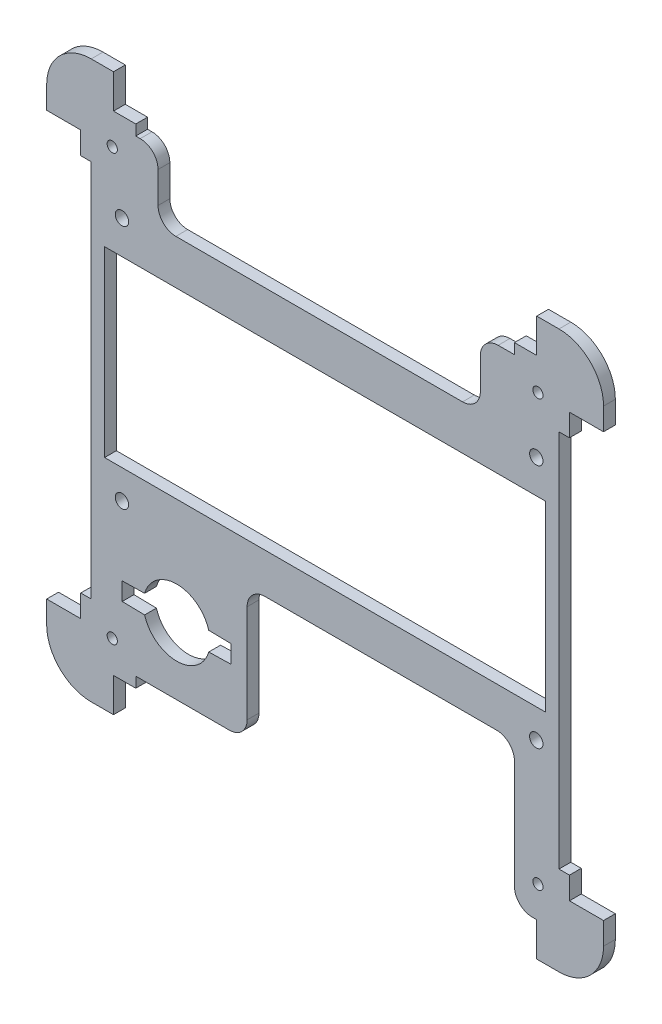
from build123d import *

# Parameters (mm, degrees)
SALIENTE_EXTRUIR1_DEPTH = 2.65
CROQUIS2_W              = 99
CROQUIS2_H              = 41
CORTAR_EXTRUIR1_DEPTH   = 2.65
CROQUIS4_R              = 1.15
CORTAR_EXTRUIR4_DEPTH   = 2.65
CROQUIS5_R              = 1.5
CORTAR_EXTRUIR5_DEPTH   = 2.65
CROQUIS6_R              = 1.5
CORTAR_EXTRUIR6_DEPTH   = 2.65
CROQUIS7_W              = 19
CROQUIS7_H              = 2.65
CORTAR_EXTRUIR7_DEPTH   = 15
CORTAR_EXTRUIR8_REACH   = 178.797
CROQUIS8_W              = 12
CROQUIS8_H              = 12
CORTAR_EXTRUIR9_REACH   = 178.797
CROQUIS9_W              = 60
CROQUIS9_H              = 30
CORTAR_EXTRUIR10_REACH  = 178.797
CORTAR_EXTRUIR11_REACH  = 178.797
CROQUIS11_W             = 53.35
CROQUIS11_H             = 15
REDONDEO1_R             = 4


with BuildPart() as part:
    # Croquis1 → Saliente-Extruir1 (new body)
    with BuildSketch(Plane.XY):
        with BuildLine():
            Line((115, 125), (110, 125))
            Line((110, 125), (110, 117.35))
            Line((110, 117.35), (105, 117.35))
            Line((105, 117.35), (105, 115))
            Line((105, 115), (20, 115))
            Line((20, 115), (20, 117.35))
            Line((20, 117.35), (15, 117.35))
            Line((15, 117.35), (15, 125))
            Line((15, 125), (10, 125))
            ThreePointArc((10, 125), (2.928932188, 122.071067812), (0, 115))
            Line((0, 115), (0, 110))
            Line((0, 110), (7.65, 110))
            Line((7.65, 110), (7.65, 105))
            Line((7.65, 105), (10, 105))
            Line((10, 105), (10, 20))
            Line((10, 20), (7.65, 20))
            Line((7.65, 20), (7.65, 15))
            Line((7.65, 15), (0, 15))
            Line((0, 15), (0, 10))
            ThreePointArc((0, 10), (2.928932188, 2.928932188), (10, 0))
            Line((10, 0), (15, 0))
            Line((15, 0), (15, 7.65))
            Line((15, 7.65), (20, 7.65))
            Line((20, 7.65), (20, 10))
            Line((20, 10), (105, 10))
            Line((105, 10), (105, 7.65))
            Line((105, 7.65), (110, 7.65))
            Line((110, 7.65), (110, 0))
            Line((110, 0), (115, 0))
            ThreePointArc((115, 0), (122.071067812, 2.928932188), (125, 10))
            Line((125, 10), (125, 15))
            Line((125, 15), (117.35, 15))
            Line((117.35, 15), (117.35, 20))
            Line((117.35, 20), (115, 20))
            Line((115, 20), (115, 105))
            Line((115, 105), (117.35, 105))
            Line((117.35, 105), (117.35, 110))
            Line((117.35, 110), (125, 110))
            Line((125, 110), (125, 115))
            ThreePointArc((125, 115), (122.071067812, 122.071067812), (115, 125))
        make_face()
    extrude(amount=SALIENTE_EXTRUIR1_DEPTH)

    # Croquis2 → Cortar-Extruir1 (cut)
    with BuildSketch(Plane.XY.offset(2.65)):
        with Locations((62.5, 69.5)):
            Rectangle(CROQUIS2_W, CROQUIS2_H)
    extrude(amount=-CORTAR_EXTRUIR1_DEPTH, mode=Mode.SUBTRACT)

    # Croquis4 → Cortar-Extruir4 (cut)
    with BuildSketch(Plane.XY.offset(2.65)):
        with Locations((14.721067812, 110.278932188)):
            Circle(CROQUIS4_R)
        with Locations((110.278932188, 110.278932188)):
            Circle(CROQUIS4_R)
        with Locations((110.278932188, 14.721067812)):
            Circle(CROQUIS4_R)
        with Locations((14.721067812, 14.721067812)):
            Circle(CROQUIS4_R)
    extrude(amount=-CORTAR_EXTRUIR4_DEPTH, mode=Mode.SUBTRACT)

    # Croquis5 → Cortar-Extruir5 (cut)
    with BuildSketch(Plane(origin=(0, 0, 0), x_dir=(-1, 0, 0), z_dir=(0, 0, -1))):
        with Locations((-55.5, 34.5)):
            Circle(CROQUIS5_R)
        with Locations((-99.5, 20.5)):
            Circle(CROQUIS5_R)
    extrude(amount=-CORTAR_EXTRUIR5_DEPTH, mode=Mode.SUBTRACT)

    # Croquis6 → Cortar-Extruir6 (cut)
    with BuildSketch(Plane(origin=(0, 0, 0), x_dir=(-1, 0, 0), z_dir=(0, 0, -1))):
        with Locations((-16.9, 42.5)):
            Circle(CROQUIS6_R)
        with Locations((-109.9, 42.5)):
            Circle(CROQUIS6_R)
        with Locations((-109.9, 97.5)):
            Circle(CROQUIS6_R)
        with Locations((-16.9, 97.5)):
            Circle(CROQUIS6_R)
    extrude(amount=-CORTAR_EXTRUIR6_DEPTH, mode=Mode.SUBTRACT)

    # Croquis7 → Cortar-Extruir7 (cut)
    with BuildSketch(Plane(origin=(0, 115, 0), x_dir=(1, 0, 0), z_dir=(0, 1, 0))):
        with Locations((87.85, -1.325)):
            Rectangle(CROQUIS7_W, CROQUIS7_H)
    extrude(amount=-CORTAR_EXTRUIR7_DEPTH, mode=Mode.SUBTRACT)

    # Croquis8 → Cortar-Extruir8 (cut, up to next)
    with BuildSketch(Plane.XY.offset(2.65), mode=Mode.PRIVATE) as cortar_extruir8_sk1:
        with Locations((83.5, 24.865620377)):
            Rectangle(CROQUIS8_W, CROQUIS8_H)
    cortar_extruir8_tool1 = extrude(cortar_extruir8_sk1.sketch, amount=-CORTAR_EXTRUIR8_REACH, mode=Mode.PRIVATE) & part.part
    add(cortar_extruir8_tool1.solids().sort_by_distance((83.5, 24.86562, 2.65))[0], mode=Mode.SUBTRACT)

    # Croquis9 → Cortar-Extruir9 (cut, up to next)
    with BuildSketch(Plane.XY.offset(2.65), mode=Mode.PRIVATE) as cortar_extruir9_sk1:
        with Locations((75, 25)):
            Rectangle(CROQUIS9_W, CROQUIS9_H)
    cortar_extruir9_tool1 = extrude(cortar_extruir9_sk1.sketch, amount=-CORTAR_EXTRUIR9_REACH, mode=Mode.PRIVATE) & part.part
    add(cortar_extruir9_tool1.solids().sort_by_distance((75, 25, 2.65))[0], mode=Mode.SUBTRACT)

    # Croquis10 → Cortar-Extruir10 (cut, up to next)
    with BuildSketch(Plane.XY.offset(2.65), mode=Mode.PRIVATE) as cortar_extruir10_sk1:
        with BuildLine():
            Line((21.987645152, 27.101516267), (16.958786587, 27))
            Line((16.958786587, 27), (16.958786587, 23))
            Line((16.958786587, 23), (21.987645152, 22.898483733))
            ThreePointArc((21.987645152, 22.898483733), (29.187202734, 17.5), (36.386760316, 22.898483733))
            Line((36.386760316, 22.898483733), (41.415618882, 23))
            Line((41.415618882, 23), (41.415618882, 27))
            Line((41.415618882, 27), (36.386760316, 27.101516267))
            ThreePointArc((36.386760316, 27.101516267), (29.187202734, 32.5), (21.987645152, 27.101516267))
        make_face()
    cortar_extruir10_tool1 = extrude(cortar_extruir10_sk1.sketch, amount=-CORTAR_EXTRUIR10_REACH, mode=Mode.PRIVATE) & part.part
    add(cortar_extruir10_tool1.solids().sort_by_distance((29.187203, 25, 2.65))[0], mode=Mode.SUBTRACT)

    # Croquis11 → Cortar-Extruir11 (cut, up to next)
    with BuildSketch(Plane(origin=(0, 0, 0), x_dir=(-1, 0, 0), z_dir=(0, 0, -1)), mode=Mode.PRIVATE) as cortar_extruir11_sk1:
        with Locations((-51.675, 107.5)):
            Rectangle(CROQUIS11_W, CROQUIS11_H)
    cortar_extruir11_tool1 = extrude(cortar_extruir11_sk1.sketch, amount=-CORTAR_EXTRUIR11_REACH, mode=Mode.PRIVATE) & part.part
    add(cortar_extruir11_tool1.solids().sort_by_distance((51.675, 107.5, 0))[0], mode=Mode.SUBTRACT)

    # Redondeo1
    redondeo1_edges = [part.edges().sort_by_distance(p)[0] for p in [
        (97.35, 100, 1.325),
        (97.35, 115, 1.325),
        (105, 40, 1.325),
        (45, 10, 1.325),
        (45, 40, 1.325),
        (25, 115, 1.325),
        (25, 100, 1.325),
        (105, 7.65, 1.325),
    ]]
    fillet(redondeo1_edges, radius=REDONDEO1_R)


solid = part.part
